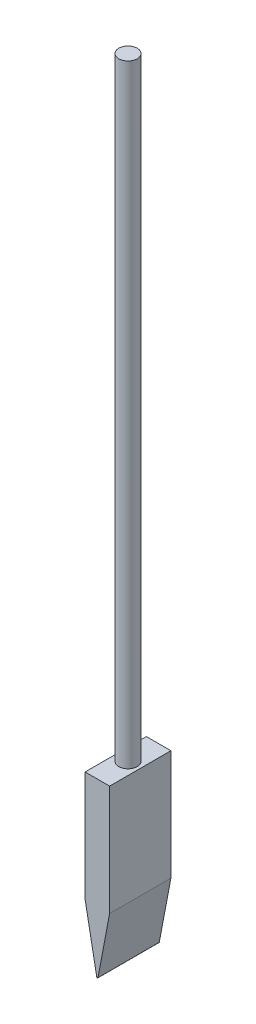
ISO-10303-21;
HEADER;
FILE_DESCRIPTION(('STEP AP214'),'2;1');
FILE_NAME('part.step','',(''),(''),'','','');
FILE_SCHEMA(('AUTOMOTIVE_DESIGN { 1 0 10303 214 1 1 1 1 }'));
ENDSEC;
DATA;
#1=APPLICATION_CONTEXT('core data for automotive mechanical design processes');
#2=APPLICATION_PROTOCOL_DEFINITION('international standard','automotive_design',2000,#1);
#3=PRODUCT_CONTEXT('',#1,'mechanical');
#4=PRODUCT('Part','Part','',(#3));
#5=PRODUCT_RELATED_PRODUCT_CATEGORY('part','',(#4));
#6=PRODUCT_DEFINITION_FORMATION('','',#4);
#7=PRODUCT_DEFINITION_CONTEXT('part definition',#1,'design');
#8=PRODUCT_DEFINITION('design','',#6,#7);
#9=PRODUCT_DEFINITION_SHAPE('','',#8);
#10=(LENGTH_UNIT() NAMED_UNIT(*) SI_UNIT(.MILLI.,.METRE.));
#11=(NAMED_UNIT(*) PLANE_ANGLE_UNIT() SI_UNIT($,.RADIAN.));
#12=(NAMED_UNIT(*) SI_UNIT($,.STERADIAN.) SOLID_ANGLE_UNIT());
#13=UNCERTAINTY_MEASURE_WITH_UNIT(LENGTH_MEASURE(1.E-05),#10,'distance_accuracy_value','');
#14=(GEOMETRIC_REPRESENTATION_CONTEXT(3) GLOBAL_UNCERTAINTY_ASSIGNED_CONTEXT((#13)) GLOBAL_UNIT_ASSIGNED_CONTEXT((#10,
#11,#12)) REPRESENTATION_CONTEXT('',''));
#15=CARTESIAN_POINT('',(0.,0.,0.));
#16=DIRECTION('',(0.,0.,1.));
#17=DIRECTION('',(1.,0.,0.));
#18=AXIS2_PLACEMENT_3D('',#15,#16,#17);
#19=CARTESIAN_POINT('',(-2.,28.,10.));
#20=DIRECTION('',(0.,-1.,0.));
#21=DIRECTION('',(0.,0.,-1.));
#22=AXIS2_PLACEMENT_3D('',#19,#20,#21);
#23=PLANE('',#22);
#24=DIRECTION('',(-1.,0.,0.));
#25=VECTOR('',#24,1.);
#26=CARTESIAN_POINT('',(-2.,28.,0.));
#27=LINE('',#26,#25);
#28=CARTESIAN_POINT('',(2.,28.,0.));
#29=VERTEX_POINT('',#28);
#30=CARTESIAN_POINT('',(-2.,28.,0.));
#31=VERTEX_POINT('',#30);
#32=EDGE_CURVE('E84',#29,#31,#27,.T.);
#33=ORIENTED_EDGE('',*,*,#32,.T.);
#34=DIRECTION('',(0.,0.,-1.));
#35=VECTOR('',#34,1.);
#36=CARTESIAN_POINT('',(-2.,28.,10.));
#37=LINE('',#36,#35);
#38=CARTESIAN_POINT('',(-2.,28.,10.));
#39=VERTEX_POINT('',#38);
#40=EDGE_CURVE('E101',#39,#31,#37,.T.);
#41=ORIENTED_EDGE('',*,*,#40,.F.);
#42=DIRECTION('',(-1.,0.,0.));
#43=VECTOR('',#42,1.);
#44=CARTESIAN_POINT('',(-2.,28.,10.));
#45=LINE('',#44,#43);
#46=CARTESIAN_POINT('',(2.,28.,10.));
#47=VERTEX_POINT('',#46);
#48=EDGE_CURVE('E98',#47,#39,#45,.T.);
#49=ORIENTED_EDGE('',*,*,#48,.F.);
#50=DIRECTION('',(0.,0.,-1.));
#51=VECTOR('',#50,1.);
#52=CARTESIAN_POINT('',(2.,28.,10.));
#53=LINE('',#52,#51);
#54=EDGE_CURVE('E39',#47,#29,#53,.T.);
#55=ORIENTED_EDGE('',*,*,#54,.T.);
#56=EDGE_LOOP('',(#33,#41,#49,#55));
#57=FACE_BOUND('',#56,.T.);
#58=CARTESIAN_POINT('',(0.,28.,5.));
#59=DIRECTION('',(0.,-1.,0.));
#60=DIRECTION('',(0.,0.,-1.));
#61=AXIS2_PLACEMENT_3D('',#58,#59,#60);
#62=CIRCLE('',#61,1.5);
#63=CARTESIAN_POINT('',(0.,28.,3.5));
#64=VERTEX_POINT('',#63);
#65=EDGE_CURVE('E11',#64,#64,#62,.F.);
#66=ORIENTED_EDGE('',*,*,#65,.F.);
#67=EDGE_LOOP('',(#66));
#68=FACE_BOUND('',#67,.T.);
#69=ADVANCED_FACE('F31',(#57,#68),#23,.F.);
#70=CARTESIAN_POINT('',(2.,10.,10.));
#71=DIRECTION('',(-1.,0.,0.));
#72=DIRECTION('',(0.,-1.,0.));
#73=AXIS2_PLACEMENT_3D('',#70,#71,#72);
#74=PLANE('',#73);
#75=DIRECTION('',(0.,1.,0.));
#76=VECTOR('',#75,1.);
#77=CARTESIAN_POINT('',(2.,10.,0.));
#78=LINE('',#77,#76);
#79=CARTESIAN_POINT('',(2.,10.,0.));
#80=VERTEX_POINT('',#79);
#81=EDGE_CURVE('E89',#80,#29,#78,.T.);
#82=ORIENTED_EDGE('',*,*,#81,.T.);
#83=ORIENTED_EDGE('',*,*,#54,.F.);
#84=DIRECTION('',(0.,1.,0.));
#85=VECTOR('',#84,1.);
#86=CARTESIAN_POINT('',(2.,10.,10.));
#87=LINE('',#86,#85);
#88=CARTESIAN_POINT('',(2.,10.,10.));
#89=VERTEX_POINT('',#88);
#90=EDGE_CURVE('E116',#89,#47,#87,.T.);
#91=ORIENTED_EDGE('',*,*,#90,.F.);
#92=DIRECTION('',(0.,0.,-1.));
#93=VECTOR('',#92,1.);
#94=CARTESIAN_POINT('',(2.,10.,10.));
#95=LINE('',#94,#93);
#96=EDGE_CURVE('E103',#89,#80,#95,.T.);
#97=ORIENTED_EDGE('',*,*,#96,.T.);
#98=EDGE_LOOP('',(#82,#83,#91,#97));
#99=FACE_BOUND('',#98,.T.);
#100=ADVANCED_FACE('F33',(#99),#74,.F.);
#101=CARTESIAN_POINT('',(-2.,10.,10.));
#102=DIRECTION('',(1.,0.,0.));
#103=DIRECTION('',(0.,0.,-1.));
#104=AXIS2_PLACEMENT_3D('',#101,#102,#103);
#105=PLANE('',#104);
#106=DIRECTION('',(0.,-1.,0.));
#107=VECTOR('',#106,1.);
#108=CARTESIAN_POINT('',(-2.,10.,0.));
#109=LINE('',#108,#107);
#110=CARTESIAN_POINT('',(-2.,10.,0.));
#111=VERTEX_POINT('',#110);
#112=EDGE_CURVE('E91',#31,#111,#109,.T.);
#113=ORIENTED_EDGE('',*,*,#112,.T.);
#114=DIRECTION('',(0.,0.,-1.));
#115=VECTOR('',#114,1.);
#116=CARTESIAN_POINT('',(-2.,10.,10.));
#117=LINE('',#116,#115);
#118=CARTESIAN_POINT('',(-2.,10.,10.));
#119=VERTEX_POINT('',#118);
#120=EDGE_CURVE('E132',#119,#111,#117,.T.);
#121=ORIENTED_EDGE('',*,*,#120,.F.);
#122=DIRECTION('',(0.,-1.,0.));
#123=VECTOR('',#122,1.);
#124=CARTESIAN_POINT('',(-2.,10.,10.));
#125=LINE('',#124,#123);
#126=EDGE_CURVE('E119',#39,#119,#125,.T.);
#127=ORIENTED_EDGE('',*,*,#126,.F.);
#128=ORIENTED_EDGE('',*,*,#40,.T.);
#129=EDGE_LOOP('',(#113,#121,#127,#128));
#130=FACE_BOUND('',#129,.T.);
#131=ADVANCED_FACE('F137',(#130),#105,.F.);
#132=CARTESIAN_POINT('',(-2.,10.,10.));
#133=DIRECTION('',(0.982456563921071,0.1864915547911,0.));
#134=DIRECTION('',(-0.1864915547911,0.982456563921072,0.));
#135=AXIS2_PLACEMENT_3D('',#132,#133,#134);
#136=PLANE('',#135);
#137=DIRECTION('',(0.1864915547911,-0.982456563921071,0.));
#138=VECTOR('',#137,1.);
#139=CARTESIAN_POINT('',(-2.,10.,0.));
#140=LINE('',#139,#138);
#141=CARTESIAN_POINT('',(-0.0982432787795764,-0.0186487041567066,0.));
#142=VERTEX_POINT('',#141);
#143=EDGE_CURVE('E110',#111,#142,#140,.T.);
#144=ORIENTED_EDGE('',*,*,#143,.T.);
#145=DIRECTION('',(0.,0.,-1.));
#146=VECTOR('',#145,1.);
#147=CARTESIAN_POINT('',(-0.0982432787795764,-0.0186487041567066,10.));
#148=LINE('',#147,#146);
#149=CARTESIAN_POINT('',(-0.0982432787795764,-0.0186487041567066,10.));
#150=VERTEX_POINT('',#149);
#151=EDGE_CURVE('E129',#150,#142,#148,.T.);
#152=ORIENTED_EDGE('',*,*,#151,.F.);
#153=DIRECTION('',(0.1864915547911,-0.982456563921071,0.));
#154=VECTOR('',#153,1.);
#155=CARTESIAN_POINT('',(-2.,10.,10.));
#156=LINE('',#155,#154);
#157=EDGE_CURVE('E121',#119,#150,#156,.T.);
#158=ORIENTED_EDGE('',*,*,#157,.F.);
#159=ORIENTED_EDGE('',*,*,#120,.T.);
#160=EDGE_LOOP('',(#144,#152,#158,#159));
#161=FACE_BOUND('',#160,.T.);
#162=ADVANCED_FACE('F143',(#161),#136,.F.);
#163=CARTESIAN_POINT('',(0.,0.,10.));
#164=DIRECTION('',(0.,0.,-1.));
#165=DIRECTION('',(-1.,0.,0.));
#166=AXIS2_PLACEMENT_3D('',#163,#164,#165);
#167=CYLINDRICAL_SURFACE('',#166,0.099997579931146);
#168=CARTESIAN_POINT('',(0.,0.,0.));
#169=DIRECTION('',(0.,0.,1.));
#170=DIRECTION('',(1.,0.,0.));
#171=AXIS2_PLACEMENT_3D('',#168,#169,#170);
#172=CIRCLE('',#171,0.099997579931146);
#173=CARTESIAN_POINT('',(0.0982432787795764,-0.0186487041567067,0.));
#174=VERTEX_POINT('',#173);
#175=EDGE_CURVE('E112',#142,#174,#172,.T.);
#176=ORIENTED_EDGE('',*,*,#175,.T.);
#177=DIRECTION('',(0.,0.,-1.));
#178=VECTOR('',#177,1.);
#179=CARTESIAN_POINT('',(0.0982432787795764,-0.0186487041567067,10.));
#180=LINE('',#179,#178);
#181=CARTESIAN_POINT('',(0.0982432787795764,-0.0186487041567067,10.));
#182=VERTEX_POINT('',#181);
#183=EDGE_CURVE('E126',#182,#174,#180,.T.);
#184=ORIENTED_EDGE('',*,*,#183,.F.);
#185=CARTESIAN_POINT('',(0.,0.,10.));
#186=DIRECTION('',(0.,0.,1.));
#187=DIRECTION('',(1.,0.,0.));
#188=AXIS2_PLACEMENT_3D('',#185,#186,#187);
#189=CIRCLE('',#188,0.099997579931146);
#190=EDGE_CURVE('E51',#150,#182,#189,.T.);
#191=ORIENTED_EDGE('',*,*,#190,.F.);
#192=ORIENTED_EDGE('',*,*,#151,.T.);
#193=EDGE_LOOP('',(#176,#184,#191,#192));
#194=FACE_BOUND('',#193,.T.);
#195=ADVANCED_FACE('F146',(#194),#167,.T.);
#196=CARTESIAN_POINT('',(2.,10.,10.));
#197=DIRECTION('',(-0.982456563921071,0.1864915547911,0.));
#198=DIRECTION('',(-0.1864915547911,-0.982456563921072,0.));
#199=AXIS2_PLACEMENT_3D('',#196,#197,#198);
#200=PLANE('',#199);
#201=DIRECTION('',(0.1864915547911,0.982456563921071,0.));
#202=VECTOR('',#201,1.);
#203=CARTESIAN_POINT('',(2.,10.,0.));
#204=LINE('',#203,#202);
#205=EDGE_CURVE('E114',#174,#80,#204,.T.);
#206=ORIENTED_EDGE('',*,*,#205,.T.);
#207=ORIENTED_EDGE('',*,*,#96,.F.);
#208=DIRECTION('',(0.1864915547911,0.982456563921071,0.));
#209=VECTOR('',#208,1.);
#210=CARTESIAN_POINT('',(2.,10.,10.));
#211=LINE('',#210,#209);
#212=EDGE_CURVE('E46',#182,#89,#211,.T.);
#213=ORIENTED_EDGE('',*,*,#212,.F.);
#214=ORIENTED_EDGE('',*,*,#183,.T.);
#215=EDGE_LOOP('',(#206,#207,#213,#214));
#216=FACE_BOUND('',#215,.T.);
#217=ADVANCED_FACE('F148',(#216),#200,.F.);
#218=CARTESIAN_POINT('',(0.,0.,10.));
#219=DIRECTION('',(0.,0.,1.));
#220=DIRECTION('',(1.,0.,0.));
#221=AXIS2_PLACEMENT_3D('',#218,#219,#220);
#222=PLANE('',#221);
#223=ORIENTED_EDGE('',*,*,#90,.T.);
#224=ORIENTED_EDGE('',*,*,#48,.T.);
#225=ORIENTED_EDGE('',*,*,#126,.T.);
#226=ORIENTED_EDGE('',*,*,#157,.T.);
#227=ORIENTED_EDGE('',*,*,#190,.T.);
#228=ORIENTED_EDGE('',*,*,#212,.T.);
#229=EDGE_LOOP('',(#223,#224,#225,#226,#227,#228));
#230=FACE_BOUND('',#229,.T.);
#231=ADVANCED_FACE('F140',(#230),#222,.T.);
#232=CARTESIAN_POINT('',(0.,0.,0.));
#233=DIRECTION('',(0.,0.,1.));
#234=DIRECTION('',(1.,0.,0.));
#235=AXIS2_PLACEMENT_3D('',#232,#233,#234);
#236=PLANE('',#235);
#237=ORIENTED_EDGE('',*,*,#81,.F.);
#238=ORIENTED_EDGE('',*,*,#205,.F.);
#239=ORIENTED_EDGE('',*,*,#175,.F.);
#240=ORIENTED_EDGE('',*,*,#143,.F.);
#241=ORIENTED_EDGE('',*,*,#112,.F.);
#242=ORIENTED_EDGE('',*,*,#32,.F.);
#243=EDGE_LOOP('',(#237,#238,#239,#240,#241,#242));
#244=FACE_BOUND('',#243,.T.);
#245=ADVANCED_FACE('F86',(#244),#236,.F.);
#246=CARTESIAN_POINT('',(0.,128.,5.));
#247=DIRECTION('',(0.,-1.,0.));
#248=DIRECTION('',(0.,0.,-1.));
#249=AXIS2_PLACEMENT_3D('',#246,#247,#248);
#250=CYLINDRICAL_SURFACE('',#249,1.5);
#251=CARTESIAN_POINT('',(0.,128.,5.));
#252=DIRECTION('',(0.,1.,0.));
#253=DIRECTION('',(0.,0.,1.));
#254=AXIS2_PLACEMENT_3D('',#251,#252,#253);
#255=CIRCLE('',#254,1.5);
#256=CARTESIAN_POINT('',(0.,128.,6.5));
#257=VERTEX_POINT('',#256);
#258=EDGE_CURVE('E104',#257,#257,#255,.T.);
#259=ORIENTED_EDGE('',*,*,#258,.F.);
#260=EDGE_LOOP('',(#259));
#261=FACE_BOUND('',#260,.T.);
#262=ORIENTED_EDGE('',*,*,#65,.T.);
#263=EDGE_LOOP('',(#262));
#264=FACE_BOUND('',#263,.T.);
#265=ADVANCED_FACE('F191',(#261,#264),#250,.T.);
#266=CARTESIAN_POINT('',(0.,128.,5.));
#267=DIRECTION('',(0.,1.,0.));
#268=DIRECTION('',(0.,0.,1.));
#269=AXIS2_PLACEMENT_3D('',#266,#267,#268);
#270=PLANE('',#269);
#271=ORIENTED_EDGE('',*,*,#258,.T.);
#272=EDGE_LOOP('',(#271));
#273=FACE_BOUND('',#272,.T.);
#274=ADVANCED_FACE('F205',(#273),#270,.T.);
#275=CLOSED_SHELL('',(#69,#100,#131,#162,#195,#217,#231,#245,#265,#274));
#276=MANIFOLD_SOLID_BREP('B2',#275);
#277=ADVANCED_BREP_SHAPE_REPRESENTATION('',(#18,#276),#14);
#278=SHAPE_DEFINITION_REPRESENTATION(#9,#277);
ENDSEC;
END-ISO-10303-21;
